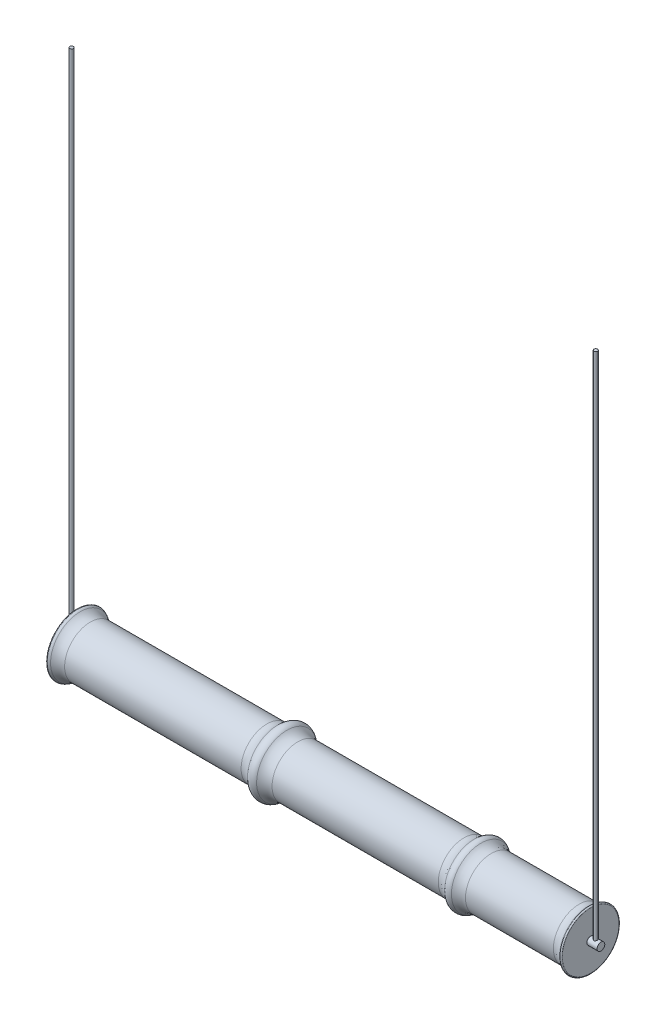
ISO-10303-21;
HEADER;
FILE_DESCRIPTION(('STEP AP214'),'2;1');
FILE_NAME('part.step','',(''),(''),'','','');
FILE_SCHEMA(('AUTOMOTIVE_DESIGN { 1 0 10303 214 1 1 1 1 }'));
ENDSEC;
DATA;
#1=APPLICATION_CONTEXT('core data for automotive mechanical design processes');
#2=APPLICATION_PROTOCOL_DEFINITION('international standard','automotive_design',2000,#1);
#3=PRODUCT_CONTEXT('',#1,'mechanical');
#4=PRODUCT('Part','Part','',(#3));
#5=PRODUCT_RELATED_PRODUCT_CATEGORY('part','',(#4));
#6=PRODUCT_DEFINITION_FORMATION('','',#4);
#7=PRODUCT_DEFINITION_CONTEXT('part definition',#1,'design');
#8=PRODUCT_DEFINITION('design','',#6,#7);
#9=PRODUCT_DEFINITION_SHAPE('','',#8);
#10=(LENGTH_UNIT() NAMED_UNIT(*) SI_UNIT(.MILLI.,.METRE.));
#11=(NAMED_UNIT(*) PLANE_ANGLE_UNIT() SI_UNIT($,.RADIAN.));
#12=(NAMED_UNIT(*) SI_UNIT($,.STERADIAN.) SOLID_ANGLE_UNIT());
#13=UNCERTAINTY_MEASURE_WITH_UNIT(LENGTH_MEASURE(1.E-05),#10,'distance_accuracy_value','');
#14=(GEOMETRIC_REPRESENTATION_CONTEXT(3) GLOBAL_UNCERTAINTY_ASSIGNED_CONTEXT((#13)) GLOBAL_UNIT_ASSIGNED_CONTEXT((#10,
#11,#12)) REPRESENTATION_CONTEXT('',''));
#15=CARTESIAN_POINT('',(0.,0.,0.));
#16=DIRECTION('',(0.,0.,1.));
#17=DIRECTION('',(1.,0.,0.));
#18=AXIS2_PLACEMENT_3D('',#15,#16,#17);
#19=CARTESIAN_POINT('',(-520.,0.,0.));
#20=DIRECTION('',(1.,0.,0.));
#21=DIRECTION('',(0.,0.,1.));
#22=AXIS2_PLACEMENT_3D('',#19,#20,#21);
#23=CYLINDRICAL_SURFACE('',#22,7.5);
#24=CARTESIAN_POINT('',(-520.,0.,0.));
#25=DIRECTION('',(1.,0.,0.));
#26=DIRECTION('',(0.,0.,-1.));
#27=AXIS2_PLACEMENT_3D('',#24,#25,#26);
#28=CIRCLE('',#27,7.5);
#29=CARTESIAN_POINT('',(-520.,0.,-7.5));
#30=VERTEX_POINT('',#29);
#31=EDGE_CURVE('E53',#30,#30,#28,.T.);
#32=ORIENTED_EDGE('',*,*,#31,.T.);
#33=EDGE_LOOP('',(#32));
#34=FACE_BOUND('',#33,.T.);
#35=CARTESIAN_POINT('',(-500.,0.,0.));
#36=DIRECTION('',(1.,0.,0.));
#37=DIRECTION('',(0.,0.,-1.));
#38=AXIS2_PLACEMENT_3D('',#35,#36,#37);
#39=CIRCLE('',#38,7.5);
#40=CARTESIAN_POINT('',(-500.,0.,-7.5));
#41=VERTEX_POINT('',#40);
#42=EDGE_CURVE('E57',#41,#41,#39,.T.);
#43=ORIENTED_EDGE('',*,*,#42,.F.);
#44=EDGE_LOOP('',(#43));
#45=FACE_BOUND('',#44,.T.);
#46=CARTESIAN_POINT('',(-510.,6.63324958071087,-3.50000000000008));
#47=CARTESIAN_POINT('',(-509.90785613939,6.63325043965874,-3.49999926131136));
#48=CARTESIAN_POINT('',(-509.815693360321,6.63517633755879,-3.49635593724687));
#49=CARTESIAN_POINT('',(-509.632061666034,6.64281200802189,-3.48182616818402));
#50=CARTESIAN_POINT('',(-509.540593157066,6.64852384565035,-3.47093577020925));
#51=CARTESIAN_POINT('',(-509.358915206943,6.66354142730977,-3.44201715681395));
#52=CARTESIAN_POINT('',(-509.268708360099,6.67285369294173,-3.42397598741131));
#53=CARTESIAN_POINT('',(-509.090352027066,6.69474455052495,-3.38097200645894));
#54=CARTESIAN_POINT('',(-509.002203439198,6.7073245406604,-3.35600623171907));
#55=CARTESIAN_POINT('',(-508.742636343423,6.74922269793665,-3.27138747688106));
#56=CARTESIAN_POINT('',(-508.575015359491,6.78279629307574,-3.20183735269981));
#57=CARTESIAN_POINT('',(-508.253950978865,6.85741831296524,-3.03871915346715));
#58=CARTESIAN_POINT('',(-508.100506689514,6.8984662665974,-2.94515259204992));
#59=CARTESIAN_POINT('',(-507.799905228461,6.98701266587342,-2.7287822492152));
#60=CARTESIAN_POINT('',(-507.653978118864,7.03476239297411,-2.60436854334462));
#61=CARTESIAN_POINT('',(-507.384129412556,7.12928988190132,-2.33320405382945));
#62=CARTESIAN_POINT('',(-507.260217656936,7.17606720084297,-2.18644333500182));
#63=CARTESIAN_POINT('',(-507.031038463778,7.26656834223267,-1.86452679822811));
#64=CARTESIAN_POINT('',(-506.927232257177,7.30996718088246,-1.68823074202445));
#65=CARTESIAN_POINT('',(-506.751303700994,7.3856412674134,-1.3182776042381));
#66=CARTESIAN_POINT('',(-506.679163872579,7.41792264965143,-1.12463017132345));
#67=CARTESIAN_POINT('',(-506.57331732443,7.46592765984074,-0.738475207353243));
#68=CARTESIAN_POINT('',(-506.537465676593,7.48257054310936,-0.546672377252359));
#69=CARTESIAN_POINT('',(-506.498205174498,7.50081627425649,-0.159103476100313));
#70=CARTESIAN_POINT('',(-506.494779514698,7.50242691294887,0.0366604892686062));
#71=CARTESIAN_POINT('',(-506.519514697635,7.49090759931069,0.410695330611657));
#72=CARTESIAN_POINT('',(-506.545294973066,7.47888852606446,0.589165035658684));
#73=CARTESIAN_POINT('',(-506.623525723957,7.44307550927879,0.938902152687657));
#74=CARTESIAN_POINT('',(-506.675978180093,7.41928069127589,1.11016902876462));
#75=CARTESIAN_POINT('',(-506.806557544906,7.3616983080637,1.44378221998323));
#76=CARTESIAN_POINT('',(-506.885055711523,7.32776699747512,1.60595739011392));
#77=CARTESIAN_POINT('',(-507.065060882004,7.25307965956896,1.9152513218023));
#78=CARTESIAN_POINT('',(-507.166576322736,7.21232113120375,2.06236453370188));
#79=CARTESIAN_POINT('',(-507.399716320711,7.12382550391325,2.35069007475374));
#80=CARTESIAN_POINT('',(-507.533167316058,7.07578970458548,2.49033646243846));
#81=CARTESIAN_POINT('',(-507.821364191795,6.98053903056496,2.74603848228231));
#82=CARTESIAN_POINT('',(-507.976122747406,6.93332466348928,2.86207997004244));
#83=CARTESIAN_POINT('',(-508.312251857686,6.84260060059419,3.0728942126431));
#84=CARTESIAN_POINT('',(-508.494562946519,6.79939178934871,3.16632273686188));
#85=CARTESIAN_POINT('',(-508.77953018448,6.74394606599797,3.28192113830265));
#86=CARTESIAN_POINT('',(-508.8764610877,6.72702242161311,3.31636861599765));
#87=CARTESIAN_POINT('',(-509.073497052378,6.69693644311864,3.37671201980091));
#88=CARTESIAN_POINT('',(-509.173600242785,6.68377193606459,3.40261288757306));
#89=CARTESIAN_POINT('',(-509.36862628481,6.66257769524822,3.44391578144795));
#90=CARTESIAN_POINT('',(-509.463381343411,6.65423909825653,3.45995493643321));
#91=CARTESIAN_POINT('',(-509.654113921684,6.64158034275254,3.48419262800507));
#92=CARTESIAN_POINT('',(-509.75009082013,6.63725821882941,3.49239499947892));
#93=CARTESIAN_POINT('',(-509.94247532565,6.63280265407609,3.50085062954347));
#94=CARTESIAN_POINT('',(-510.038882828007,6.63266824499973,3.50110572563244));
#95=CARTESIAN_POINT('',(-510.231277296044,6.636581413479,3.49367901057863));
#96=CARTESIAN_POINT('',(-510.327264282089,6.64062878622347,3.48599758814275));
#97=CARTESIAN_POINT('',(-510.596335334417,6.65775748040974,3.45324638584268));
#98=CARTESIAN_POINT('',(-510.768113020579,6.67552471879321,3.4190840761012));
#99=CARTESIAN_POINT('',(-511.103146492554,6.72229645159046,3.32616520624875));
#100=CARTESIAN_POINT('',(-511.266399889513,6.75130407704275,3.26740179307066));
#101=CARTESIAN_POINT('',(-511.588352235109,6.81886757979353,3.12403403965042));
#102=CARTESIAN_POINT('',(-511.746496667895,6.85780114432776,3.03836581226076));
#103=CARTESIAN_POINT('',(-512.047021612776,6.94041543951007,2.84459425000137));
#104=CARTESIAN_POINT('',(-512.189394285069,6.98409850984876,2.73647983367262));
#105=CARTESIAN_POINT('',(-512.47022319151,7.07690614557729,2.48734285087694));
#106=CARTESIAN_POINT('',(-512.606637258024,7.12611360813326,2.34403888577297));
#107=CARTESIAN_POINT('',(-512.854008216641,7.22026743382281,2.03561304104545));
#108=CARTESIAN_POINT('',(-512.964959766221,7.26521290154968,1.87048659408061));
#109=CARTESIAN_POINT('',(-513.159434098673,7.34670682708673,1.51947024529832));
#110=CARTESIAN_POINT('',(-513.242530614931,7.38312242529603,1.33331127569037));
#111=CARTESIAN_POINT('',(-513.375474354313,7.4424632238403,0.947480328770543));
#112=CARTESIAN_POINT('',(-513.425346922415,7.46539870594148,0.747818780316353));
#113=CARTESIAN_POINT('',(-513.486672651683,7.49374585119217,0.358651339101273));
#114=CARTESIAN_POINT('',(-513.500985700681,7.50046065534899,0.169689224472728));
#115=CARTESIAN_POINT('',(-513.498909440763,7.49949041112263,-0.208004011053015));
#116=CARTESIAN_POINT('',(-513.48252830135,7.49180919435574,-0.396735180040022));
#117=CARTESIAN_POINT('',(-513.421531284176,7.46365916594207,-0.758277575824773));
#118=CARTESIAN_POINT('',(-513.378439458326,7.44388132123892,-0.931404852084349));
#119=CARTESIAN_POINT('',(-513.267128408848,7.39402864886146,-1.26778311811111));
#120=CARTESIAN_POINT('',(-513.198905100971,7.3639521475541,-1.43103249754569));
#121=CARTESIAN_POINT('',(-513.035923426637,7.29459745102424,-1.75125880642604));
#122=CARTESIAN_POINT('',(-512.940101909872,7.2549637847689,-1.90761543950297));
#123=CARTESIAN_POINT('',(-512.726040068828,7.17088679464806,-2.20271728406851));
#124=CARTESIAN_POINT('',(-512.60778966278,7.12644131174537,-2.34145452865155));
#125=CARTESIAN_POINT('',(-512.340206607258,7.03274489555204,-2.61006924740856));
#126=CARTESIAN_POINT('',(-512.189061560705,6.98341321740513,-2.73811546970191));
#127=CARTESIAN_POINT('',(-511.866192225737,6.88904451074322,-2.96757613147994));
#128=CARTESIAN_POINT('',(-511.694453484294,6.84401053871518,-3.06897170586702));
#129=CARTESIAN_POINT('',(-511.423311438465,6.7836471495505,-3.19913423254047));
#130=CARTESIAN_POINT('',(-511.329950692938,6.76461324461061,-3.23907342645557));
#131=CARTESIAN_POINT('',(-511.139595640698,6.72978037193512,-3.31083809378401));
#132=CARTESIAN_POINT('',(-511.042603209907,6.71397976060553,-3.34266769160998));
#133=CARTESIAN_POINT('',(-510.845956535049,6.68626866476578,-3.39775826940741));
#134=CARTESIAN_POINT('',(-510.746309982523,6.67434803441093,-3.42104161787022));
#135=CARTESIAN_POINT('',(-510.544997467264,6.65484829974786,-3.45882212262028));
#136=CARTESIAN_POINT('',(-510.443333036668,6.64726602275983,-3.47332570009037));
#137=CARTESIAN_POINT('',(-510.284507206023,6.63910656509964,-3.48888207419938));
#138=CARTESIAN_POINT('',(-510.227713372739,6.63691338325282,-3.49304884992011));
#139=CARTESIAN_POINT('',(-510.113948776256,6.63398459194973,-3.49860810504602));
#140=CARTESIAN_POINT('',(-510.056978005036,6.63324904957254,-3.50000045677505));
#141=CARTESIAN_POINT('',(-510.,6.63324958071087,-3.50000000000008));
#142=B_SPLINE_CURVE_WITH_KNOTS('',3,(#46,#47,#48,#49,#50,#51,#52,#53,#54,#55,#56,#57,#58,#59,
#60,#61,#62,#63,#64,#65,#66,#67,#68,#69,#70,#71,#72,#73,#74,#75,#76,#77,#78,#79,#80,#81,#82,#83,
#84,#85,#86,#87,#88,#89,#90,#91,#92,#93,#94,#95,#96,#97,#98,#99,#100,#101,#102,#103,#104,#105,
#106,#107,#108,#109,#110,#111,#112,#113,#114,#115,#116,#117,#118,#119,#120,#121,#122,#123,#124,
#125,#126,#127,#128,#129,#130,#131,#132,#133,#134,#135,#136,#137,#138,#139,#140,#141),
.UNSPECIFIED.,.T.,.F.,(4,2,2,2,2,2,2,2,2,2,2,2,2,2,2,2,2,2,2,2,2,2,2,2,2,2,2,2,2,2,2,2,2,2,2,2,
2,2,2,2,2,2,2,2,2,2,2,4),(0.,0.276372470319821,0.552895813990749,0.82992240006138,
1.10706771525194,1.65810114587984,2.20909985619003,2.79941855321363,3.39000046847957,
4.01417190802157,4.6379983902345,5.22231177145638,5.80632230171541,6.34595217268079,
6.88562212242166,7.43334106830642,7.98126110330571,8.5757804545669,9.17065500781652,
9.79510464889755,10.1074819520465,10.4196783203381,10.7086761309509,10.9975324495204,
11.2863219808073,11.5750973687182,12.100612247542,12.6262736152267,13.1761037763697,
13.7262060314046,14.3350584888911,14.9440385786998,15.561952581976,16.1793946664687,
16.7452887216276,17.3110321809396,17.8471387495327,18.3833324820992,18.9438451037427,
19.5046102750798,20.114337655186,20.7244954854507,21.0340784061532,21.3435035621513,
21.6521129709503,21.9604964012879,22.1313860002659,22.302283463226),.UNSPECIFIED.);
#143=CARTESIAN_POINT('',(-510.,6.63324958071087,-3.50000000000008));
#144=VERTEX_POINT('',#143);
#145=EDGE_CURVE('E11',#144,#144,#142,.T.);
#146=ORIENTED_EDGE('',*,*,#145,.T.);
#147=EDGE_LOOP('',(#146));
#148=FACE_BOUND('',#147,.T.);
#149=ADVANCED_FACE('F42',(#34,#45,#148),#23,.T.);
#150=CARTESIAN_POINT('',(-520.,0.,0.));
#151=DIRECTION('',(-1.,0.,0.));
#152=DIRECTION('',(0.,0.,-1.));
#153=AXIS2_PLACEMENT_3D('',#150,#151,#152);
#154=PLANE('',#153);
#155=ORIENTED_EDGE('',*,*,#31,.F.);
#156=EDGE_LOOP('',(#155));
#157=FACE_BOUND('',#156,.T.);
#158=ADVANCED_FACE('F78',(#157),#154,.T.);
#159=CARTESIAN_POINT('',(-500.,0.,0.));
#160=DIRECTION('',(-1.,0.,0.));
#161=DIRECTION('',(0.,0.,-1.));
#162=AXIS2_PLACEMENT_3D('',#159,#160,#161);
#163=PLANE('',#162);
#164=ORIENTED_EDGE('',*,*,#42,.T.);
#165=EDGE_LOOP('',(#164));
#166=FACE_BOUND('',#165,.T.);
#167=ADVANCED_FACE('F76',(#166),#163,.F.);
#168=CARTESIAN_POINT('',(-510.,1000.,0.));
#169=DIRECTION('',(0.,-1.,0.));
#170=DIRECTION('',(0.,0.,-1.));
#171=AXIS2_PLACEMENT_3D('',#168,#169,#170);
#172=CYLINDRICAL_SURFACE('',#171,3.50000000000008);
#173=CARTESIAN_POINT('',(-510.,1000.,0.));
#174=DIRECTION('',(0.,-1.,0.));
#175=DIRECTION('',(0.,0.,1.));
#176=AXIS2_PLACEMENT_3D('',#173,#174,#175);
#177=CIRCLE('',#176,3.50000000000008);
#178=CARTESIAN_POINT('',(-510.,1000.,3.50000000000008));
#179=VERTEX_POINT('',#178);
#180=EDGE_CURVE('E62',#179,#179,#177,.T.);
#181=ORIENTED_EDGE('',*,*,#180,.T.);
#182=EDGE_LOOP('',(#181));
#183=FACE_BOUND('',#182,.T.);
#184=ORIENTED_EDGE('',*,*,#145,.F.);
#185=EDGE_LOOP('',(#184));
#186=FACE_BOUND('',#185,.T.);
#187=ADVANCED_FACE('F67',(#183,#186),#172,.T.);
#188=CARTESIAN_POINT('',(-510.,1000.,0.));
#189=DIRECTION('',(0.,1.,0.));
#190=DIRECTION('',(0.,0.,1.));
#191=AXIS2_PLACEMENT_3D('',#188,#189,#190);
#192=PLANE('',#191);
#193=ORIENTED_EDGE('',*,*,#180,.F.);
#194=EDGE_LOOP('',(#193));
#195=FACE_BOUND('',#194,.T.);
#196=ADVANCED_FACE('F70',(#195),#192,.T.);
#197=CLOSED_SHELL('',(#149,#158,#167,#187,#196));
#198=MANIFOLD_SOLID_BREP('B2',#197);
#199=CARTESIAN_POINT('',(520.,0.,0.));
#200=DIRECTION('',(-1.,0.,0.));
#201=DIRECTION('',(0.,0.,1.));
#202=AXIS2_PLACEMENT_3D('',#199,#200,#201);
#203=CYLINDRICAL_SURFACE('',#202,7.5);
#204=CARTESIAN_POINT('',(520.,0.,0.));
#205=DIRECTION('',(1.,0.,0.));
#206=DIRECTION('',(0.,0.,-1.));
#207=AXIS2_PLACEMENT_3D('',#204,#205,#206);
#208=CIRCLE('',#207,7.5);
#209=CARTESIAN_POINT('',(520.,0.,-7.5));
#210=VERTEX_POINT('',#209);
#211=EDGE_CURVE('E136',#210,#210,#208,.T.);
#212=ORIENTED_EDGE('',*,*,#211,.F.);
#213=EDGE_LOOP('',(#212));
#214=FACE_BOUND('',#213,.T.);
#215=CARTESIAN_POINT('',(500.,0.,0.));
#216=DIRECTION('',(1.,0.,0.));
#217=DIRECTION('',(0.,0.,-1.));
#218=AXIS2_PLACEMENT_3D('',#215,#216,#217);
#219=CIRCLE('',#218,7.5);
#220=CARTESIAN_POINT('',(500.,0.,-7.5));
#221=VERTEX_POINT('',#220);
#222=EDGE_CURVE('E140',#221,#221,#219,.T.);
#223=ORIENTED_EDGE('',*,*,#222,.T.);
#224=EDGE_LOOP('',(#223));
#225=FACE_BOUND('',#224,.T.);
#226=CARTESIAN_POINT('',(510.,6.63324958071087,-3.50000000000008));
#227=CARTESIAN_POINT('',(509.90785613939,6.63325043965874,-3.49999926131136));
#228=CARTESIAN_POINT('',(509.815693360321,6.63517633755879,-3.49635593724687));
#229=CARTESIAN_POINT('',(509.632061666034,6.64281200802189,-3.48182616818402));
#230=CARTESIAN_POINT('',(509.540593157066,6.64852384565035,-3.47093577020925));
#231=CARTESIAN_POINT('',(509.358915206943,6.66354142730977,-3.44201715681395));
#232=CARTESIAN_POINT('',(509.268708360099,6.67285369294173,-3.42397598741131));
#233=CARTESIAN_POINT('',(509.090352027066,6.69474455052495,-3.38097200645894));
#234=CARTESIAN_POINT('',(509.002203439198,6.7073245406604,-3.35600623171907));
#235=CARTESIAN_POINT('',(508.742636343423,6.74922269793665,-3.27138747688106));
#236=CARTESIAN_POINT('',(508.575015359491,6.78279629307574,-3.20183735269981));
#237=CARTESIAN_POINT('',(508.253950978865,6.85741831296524,-3.03871915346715));
#238=CARTESIAN_POINT('',(508.100506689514,6.8984662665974,-2.94515259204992));
#239=CARTESIAN_POINT('',(507.799905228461,6.98701266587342,-2.7287822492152));
#240=CARTESIAN_POINT('',(507.653978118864,7.03476239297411,-2.60436854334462));
#241=CARTESIAN_POINT('',(507.384129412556,7.12928988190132,-2.33320405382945));
#242=CARTESIAN_POINT('',(507.260217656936,7.17606720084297,-2.18644333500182));
#243=CARTESIAN_POINT('',(507.031038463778,7.26656834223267,-1.86452679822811));
#244=CARTESIAN_POINT('',(506.927232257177,7.30996718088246,-1.68823074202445));
#245=CARTESIAN_POINT('',(506.751303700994,7.3856412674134,-1.3182776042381));
#246=CARTESIAN_POINT('',(506.679163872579,7.41792264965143,-1.12463017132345));
#247=CARTESIAN_POINT('',(506.57331732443,7.46592765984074,-0.738475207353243));
#248=CARTESIAN_POINT('',(506.537465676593,7.48257054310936,-0.546672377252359));
#249=CARTESIAN_POINT('',(506.498205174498,7.50081627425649,-0.159103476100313));
#250=CARTESIAN_POINT('',(506.494779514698,7.50242691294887,0.0366604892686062));
#251=CARTESIAN_POINT('',(506.519514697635,7.49090759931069,0.410695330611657));
#252=CARTESIAN_POINT('',(506.545294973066,7.47888852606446,0.589165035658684));
#253=CARTESIAN_POINT('',(506.623525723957,7.44307550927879,0.938902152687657));
#254=CARTESIAN_POINT('',(506.675978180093,7.41928069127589,1.11016902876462));
#255=CARTESIAN_POINT('',(506.806557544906,7.3616983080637,1.44378221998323));
#256=CARTESIAN_POINT('',(506.885055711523,7.32776699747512,1.60595739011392));
#257=CARTESIAN_POINT('',(507.065060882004,7.25307965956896,1.9152513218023));
#258=CARTESIAN_POINT('',(507.166576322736,7.21232113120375,2.06236453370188));
#259=CARTESIAN_POINT('',(507.399716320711,7.12382550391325,2.35069007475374));
#260=CARTESIAN_POINT('',(507.533167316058,7.07578970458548,2.49033646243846));
#261=CARTESIAN_POINT('',(507.821364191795,6.98053903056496,2.74603848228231));
#262=CARTESIAN_POINT('',(507.976122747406,6.93332466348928,2.86207997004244));
#263=CARTESIAN_POINT('',(508.312251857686,6.84260060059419,3.0728942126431));
#264=CARTESIAN_POINT('',(508.494562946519,6.79939178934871,3.16632273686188));
#265=CARTESIAN_POINT('',(508.77953018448,6.74394606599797,3.28192113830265));
#266=CARTESIAN_POINT('',(508.8764610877,6.72702242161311,3.31636861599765));
#267=CARTESIAN_POINT('',(509.073497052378,6.69693644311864,3.37671201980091));
#268=CARTESIAN_POINT('',(509.173600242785,6.68377193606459,3.40261288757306));
#269=CARTESIAN_POINT('',(509.36862628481,6.66257769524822,3.44391578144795));
#270=CARTESIAN_POINT('',(509.463381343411,6.65423909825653,3.45995493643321));
#271=CARTESIAN_POINT('',(509.654113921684,6.64158034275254,3.48419262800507));
#272=CARTESIAN_POINT('',(509.75009082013,6.63725821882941,3.49239499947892));
#273=CARTESIAN_POINT('',(509.94247532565,6.63280265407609,3.50085062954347));
#274=CARTESIAN_POINT('',(510.038882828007,6.63266824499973,3.50110572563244));
#275=CARTESIAN_POINT('',(510.231277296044,6.636581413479,3.49367901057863));
#276=CARTESIAN_POINT('',(510.327264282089,6.64062878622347,3.48599758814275));
#277=CARTESIAN_POINT('',(510.596335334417,6.65775748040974,3.45324638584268));
#278=CARTESIAN_POINT('',(510.768113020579,6.67552471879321,3.4190840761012));
#279=CARTESIAN_POINT('',(511.103146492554,6.72229645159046,3.32616520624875));
#280=CARTESIAN_POINT('',(511.266399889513,6.75130407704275,3.26740179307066));
#281=CARTESIAN_POINT('',(511.588352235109,6.81886757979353,3.12403403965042));
#282=CARTESIAN_POINT('',(511.746496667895,6.85780114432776,3.03836581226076));
#283=CARTESIAN_POINT('',(512.047021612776,6.94041543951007,2.84459425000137));
#284=CARTESIAN_POINT('',(512.189394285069,6.98409850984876,2.73647983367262));
#285=CARTESIAN_POINT('',(512.47022319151,7.07690614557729,2.48734285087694));
#286=CARTESIAN_POINT('',(512.606637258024,7.12611360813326,2.34403888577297));
#287=CARTESIAN_POINT('',(512.854008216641,7.22026743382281,2.03561304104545));
#288=CARTESIAN_POINT('',(512.964959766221,7.26521290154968,1.87048659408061));
#289=CARTESIAN_POINT('',(513.159434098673,7.34670682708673,1.51947024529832));
#290=CARTESIAN_POINT('',(513.242530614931,7.38312242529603,1.33331127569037));
#291=CARTESIAN_POINT('',(513.375474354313,7.4424632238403,0.947480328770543));
#292=CARTESIAN_POINT('',(513.425346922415,7.46539870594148,0.747818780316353));
#293=CARTESIAN_POINT('',(513.486672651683,7.49374585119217,0.358651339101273));
#294=CARTESIAN_POINT('',(513.500985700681,7.50046065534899,0.169689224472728));
#295=CARTESIAN_POINT('',(513.498909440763,7.49949041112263,-0.208004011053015));
#296=CARTESIAN_POINT('',(513.48252830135,7.49180919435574,-0.396735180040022));
#297=CARTESIAN_POINT('',(513.421531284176,7.46365916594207,-0.758277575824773));
#298=CARTESIAN_POINT('',(513.378439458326,7.44388132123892,-0.931404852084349));
#299=CARTESIAN_POINT('',(513.267128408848,7.39402864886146,-1.26778311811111));
#300=CARTESIAN_POINT('',(513.198905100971,7.3639521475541,-1.43103249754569));
#301=CARTESIAN_POINT('',(513.035923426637,7.29459745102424,-1.75125880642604));
#302=CARTESIAN_POINT('',(512.940101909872,7.2549637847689,-1.90761543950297));
#303=CARTESIAN_POINT('',(512.726040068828,7.17088679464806,-2.20271728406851));
#304=CARTESIAN_POINT('',(512.60778966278,7.12644131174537,-2.34145452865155));
#305=CARTESIAN_POINT('',(512.340206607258,7.03274489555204,-2.61006924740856));
#306=CARTESIAN_POINT('',(512.189061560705,6.98341321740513,-2.73811546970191));
#307=CARTESIAN_POINT('',(511.866192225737,6.88904451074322,-2.96757613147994));
#308=CARTESIAN_POINT('',(511.694453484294,6.84401053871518,-3.06897170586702));
#309=CARTESIAN_POINT('',(511.423311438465,6.7836471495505,-3.19913423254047));
#310=CARTESIAN_POINT('',(511.329950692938,6.76461324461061,-3.23907342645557));
#311=CARTESIAN_POINT('',(511.139595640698,6.72978037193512,-3.31083809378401));
#312=CARTESIAN_POINT('',(511.042603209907,6.71397976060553,-3.34266769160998));
#313=CARTESIAN_POINT('',(510.845956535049,6.68626866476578,-3.39775826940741));
#314=CARTESIAN_POINT('',(510.746309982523,6.67434803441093,-3.42104161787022));
#315=CARTESIAN_POINT('',(510.544997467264,6.65484829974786,-3.45882212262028));
#316=CARTESIAN_POINT('',(510.443333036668,6.64726602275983,-3.47332570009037));
#317=CARTESIAN_POINT('',(510.284507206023,6.63910656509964,-3.48888207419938));
#318=CARTESIAN_POINT('',(510.227713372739,6.63691338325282,-3.49304884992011));
#319=CARTESIAN_POINT('',(510.113948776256,6.63398459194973,-3.49860810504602));
#320=CARTESIAN_POINT('',(510.056978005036,6.63324904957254,-3.50000045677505));
#321=CARTESIAN_POINT('',(510.,6.63324958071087,-3.50000000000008));
#322=B_SPLINE_CURVE_WITH_KNOTS('',3,(#226,#227,#228,#229,#230,#231,#232,#233,#234,#235,#236,
#237,#238,#239,#240,#241,#242,#243,#244,#245,#246,#247,#248,#249,#250,#251,#252,#253,#254,#255,
#256,#257,#258,#259,#260,#261,#262,#263,#264,#265,#266,#267,#268,#269,#270,#271,#272,#273,#274,
#275,#276,#277,#278,#279,#280,#281,#282,#283,#284,#285,#286,#287,#288,#289,#290,#291,#292,#293,
#294,#295,#296,#297,#298,#299,#300,#301,#302,#303,#304,#305,#306,#307,#308,#309,#310,#311,#312,
#313,#314,#315,#316,#317,#318,#319,#320,#321),.UNSPECIFIED.,.T.,.F.,(4,2,2,2,2,2,2,2,2,2,2,2,2,
2,2,2,2,2,2,2,2,2,2,2,2,2,2,2,2,2,2,2,2,2,2,2,2,2,2,2,2,2,2,2,2,2,2,4),(0.,0.276372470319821,
0.552895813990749,0.82992240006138,1.10706771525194,1.65810114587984,2.20909985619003,
2.79941855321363,3.39000046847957,4.01417190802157,4.6379983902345,5.22231177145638,
5.80632230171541,6.34595217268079,6.88562212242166,7.43334106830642,7.98126110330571,
8.5757804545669,9.17065500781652,9.79510464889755,10.1074819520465,10.4196783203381,
10.7086761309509,10.9975324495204,11.2863219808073,11.5750973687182,12.100612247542,
12.6262736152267,13.1761037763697,13.7262060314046,14.3350584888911,14.9440385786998,
15.561952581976,16.1793946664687,16.7452887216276,17.3110321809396,17.8471387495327,
18.3833324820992,18.9438451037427,19.5046102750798,20.114337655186,20.7244954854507,
21.0340784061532,21.3435035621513,21.6521129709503,21.9604964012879,22.1313860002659,
22.302283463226),.UNSPECIFIED.);
#323=CARTESIAN_POINT('',(510.,6.63324958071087,-3.50000000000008));
#324=VERTEX_POINT('',#323);
#325=EDGE_CURVE('E41',#324,#324,#322,.T.);
#326=ORIENTED_EDGE('',*,*,#325,.F.);
#327=EDGE_LOOP('',(#326));
#328=FACE_BOUND('',#327,.T.);
#329=ADVANCED_FACE('F125',(#214,#225,#328),#203,.T.);
#330=CARTESIAN_POINT('',(520.,0.,0.));
#331=DIRECTION('',(1.,0.,0.));
#332=DIRECTION('',(0.,0.,-1.));
#333=AXIS2_PLACEMENT_3D('',#330,#331,#332);
#334=PLANE('',#333);
#335=ORIENTED_EDGE('',*,*,#211,.T.);
#336=EDGE_LOOP('',(#335));
#337=FACE_BOUND('',#336,.T.);
#338=ADVANCED_FACE('F160',(#337),#334,.T.);
#339=CARTESIAN_POINT('',(500.,0.,0.));
#340=DIRECTION('',(1.,0.,0.));
#341=DIRECTION('',(0.,0.,-1.));
#342=AXIS2_PLACEMENT_3D('',#339,#340,#341);
#343=PLANE('',#342);
#344=ORIENTED_EDGE('',*,*,#222,.F.);
#345=EDGE_LOOP('',(#344));
#346=FACE_BOUND('',#345,.T.);
#347=ADVANCED_FACE('F154',(#346),#343,.F.);
#348=CARTESIAN_POINT('',(510.,1000.,0.));
#349=DIRECTION('',(0.,-1.,0.));
#350=DIRECTION('',(0.,0.,-1.));
#351=AXIS2_PLACEMENT_3D('',#348,#349,#350);
#352=CYLINDRICAL_SURFACE('',#351,3.50000000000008);
#353=CARTESIAN_POINT('',(510.,1000.,0.));
#354=DIRECTION('',(0.,1.,0.));
#355=DIRECTION('',(0.,0.,1.));
#356=AXIS2_PLACEMENT_3D('',#353,#354,#355);
#357=CIRCLE('',#356,3.50000000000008);
#358=CARTESIAN_POINT('',(510.,1000.,3.50000000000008));
#359=VERTEX_POINT('',#358);
#360=EDGE_CURVE('E145',#359,#359,#357,.T.);
#361=ORIENTED_EDGE('',*,*,#360,.F.);
#362=EDGE_LOOP('',(#361));
#363=FACE_BOUND('',#362,.T.);
#364=ORIENTED_EDGE('',*,*,#325,.T.);
#365=EDGE_LOOP('',(#364));
#366=FACE_BOUND('',#365,.T.);
#367=ADVANCED_FACE('F152',(#363,#366),#352,.T.);
#368=CARTESIAN_POINT('',(510.,1000.,0.));
#369=DIRECTION('',(0.,1.,0.));
#370=DIRECTION('',(0.,0.,1.));
#371=AXIS2_PLACEMENT_3D('',#368,#369,#370);
#372=PLANE('',#371);
#373=ORIENTED_EDGE('',*,*,#360,.T.);
#374=EDGE_LOOP('',(#373));
#375=FACE_BOUND('',#374,.T.);
#376=ADVANCED_FACE('F150',(#375),#372,.T.);
#377=CLOSED_SHELL('',(#329,#338,#347,#367,#376));
#378=MANIFOLD_SOLID_BREP('B6',#377);
#379=CARTESIAN_POINT('',(500.,57.5000000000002,0.));
#380=DIRECTION('',(-1.,0.,0.));
#381=DIRECTION('',(0.,-1.,0.));
#382=AXIS2_PLACEMENT_3D('',#379,#380,#381);
#383=PLANE('',#382);
#384=CARTESIAN_POINT('',(500.,1.80411241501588E-13,0.));
#385=DIRECTION('',(-1.,0.,0.));
#386=DIRECTION('',(0.,-1.,0.));
#387=AXIS2_PLACEMENT_3D('',#384,#385,#386);
#388=CIRCLE('',#387,55.1234753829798);
#389=CARTESIAN_POINT('',(500.,-55.1234753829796,0.));
#390=VERTEX_POINT('',#389);
#391=EDGE_CURVE('E212',#390,#390,#388,.F.);
#392=ORIENTED_EDGE('',*,*,#391,.T.);
#393=EDGE_LOOP('',(#392));
#394=FACE_BOUND('',#393,.T.);
#395=ADVANCED_FACE('F201',(#394),#383,.F.);
#396=CARTESIAN_POINT('',(500.,1.80411241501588E-13,0.));
#397=DIRECTION('',(-1.,0.,0.));
#398=DIRECTION('',(0.,-1.,0.));
#399=AXIS2_PLACEMENT_3D('',#396,#397,#398);
#400=TOROIDAL_SURFACE('',#399,50.,7.49999999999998);
#401=CARTESIAN_POINT('',(497.272727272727,1.7991024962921E-13,0.));
#402=DIRECTION('',(1.,0.,0.));
#403=DIRECTION('',(0.,1.,0.));
#404=AXIS2_PLACEMENT_3D('',#401,#402,#403);
#405=CIRCLE('',#404,56.9865573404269);
#406=CARTESIAN_POINT('',(497.272727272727,56.9865573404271,0.));
#407=VERTEX_POINT('',#406);
#408=EDGE_CURVE('E216',#407,#407,#405,.F.);
#409=ORIENTED_EDGE('',*,*,#408,.T.);
#410=EDGE_LOOP('',(#409));
#411=FACE_BOUND('',#410,.T.);
#412=CARTESIAN_POINT('',(495.5,1.79584604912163E-13,0.));
#413=DIRECTION('',(1.,0.,0.));
#414=DIRECTION('',(0.,1.,0.));
#415=AXIS2_PLACEMENT_3D('',#412,#413,#414);
#416=CIRCLE('',#415,55.9999999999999);
#417=CARTESIAN_POINT('',(495.5,56.0000000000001,0.));
#418=VERTEX_POINT('',#417);
#419=EDGE_CURVE('E248',#418,#418,#416,.T.);
#420=ORIENTED_EDGE('',*,*,#419,.T.);
#421=EDGE_LOOP('',(#420));
#422=FACE_BOUND('',#421,.T.);
#423=ADVANCED_FACE('F325',(#411,#422),#400,.T.);
#424=CARTESIAN_POINT('',(-500.,0.,0.));
#425=DIRECTION('',(-1.,0.,0.));
#426=DIRECTION('',(0.,-1.,0.));
#427=AXIS2_PLACEMENT_3D('',#424,#425,#426);
#428=CYLINDRICAL_SURFACE('',#427,49.9999999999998);
#429=CARTESIAN_POINT('',(477.5,1.79563836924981E-13,0.));
#430=DIRECTION('',(-1.,0.,0.));
#431=DIRECTION('',(0.,-1.,0.));
#432=AXIS2_PLACEMENT_3D('',#429,#430,#431);
#433=CIRCLE('',#432,49.9999999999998);
#434=CARTESIAN_POINT('',(477.5,-49.9999999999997,0.));
#435=VERTEX_POINT('',#434);
#436=EDGE_CURVE('E251',#435,#435,#433,.T.);
#437=ORIENTED_EDGE('',*,*,#436,.T.);
#438=EDGE_LOOP('',(#437));
#439=FACE_BOUND('',#438,.T.);
#440=CARTESIAN_POINT('',(306.457513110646,1.48143841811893E-13,0.));
#441=DIRECTION('',(-1.,0.,0.));
#442=DIRECTION('',(0.,-1.,0.));
#443=AXIS2_PLACEMENT_3D('',#440,#441,#442);
#444=CIRCLE('',#443,49.9999999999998);
#445=CARTESIAN_POINT('',(306.457513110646,-49.9999999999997,0.));
#446=VERTEX_POINT('',#445);
#447=EDGE_CURVE('E254',#446,#446,#444,.F.);
#448=ORIENTED_EDGE('',*,*,#447,.T.);
#449=EDGE_LOOP('',(#448));
#450=FACE_BOUND('',#449,.T.);
#451=ADVANCED_FACE('F258',(#439,#450),#428,.T.);
#452=CARTESIAN_POINT('',(280.,1.45716771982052E-13,0.));
#453=DIRECTION('',(-1.,0.,0.));
#454=DIRECTION('',(0.,-1.,0.));
#455=AXIS2_PLACEMENT_3D('',#452,#453,#454);
#456=TOROIDAL_SURFACE('',#455,49.9999999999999,10.);
#457=CARTESIAN_POINT('',(286.614378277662,1.46931813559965E-13,0.));
#458=DIRECTION('',(-1.,0.,0.));
#459=DIRECTION('',(0.,-1.,0.));
#460=AXIS2_PLACEMENT_3D('',#457,#458,#459);
#461=CIRCLE('',#460,57.4999999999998);
#462=CARTESIAN_POINT('',(286.614378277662,-57.4999999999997,0.));
#463=VERTEX_POINT('',#462);
#464=EDGE_CURVE('E242',#463,#463,#461,.T.);
#465=ORIENTED_EDGE('',*,*,#464,.T.);
#466=EDGE_LOOP('',(#465));
#467=FACE_BOUND('',#466,.T.);
#468=CARTESIAN_POINT('',(273.385621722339,1.44501730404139E-13,0.));
#469=DIRECTION('',(1.,0.,0.));
#470=DIRECTION('',(0.,1.,0.));
#471=AXIS2_PLACEMENT_3D('',#468,#469,#470);
#472=CIRCLE('',#471,57.4999999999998);
#473=CARTESIAN_POINT('',(273.385621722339,57.5,0.));
#474=VERTEX_POINT('',#473);
#475=EDGE_CURVE('E245',#474,#474,#472,.T.);
#476=ORIENTED_EDGE('',*,*,#475,.T.);
#477=EDGE_LOOP('',(#476));
#478=FACE_BOUND('',#477,.T.);
#479=ADVANCED_FACE('F268',(#467,#478),#456,.T.);
#480=CARTESIAN_POINT('',(-500.,0.,0.));
#481=DIRECTION('',(-1.,0.,0.));
#482=DIRECTION('',(0.,-1.,0.));
#483=AXIS2_PLACEMENT_3D('',#480,#481,#482);
#484=CYLINDRICAL_SURFACE('',#483,49.9999999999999);
#485=CARTESIAN_POINT('',(253.542486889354,1.38423509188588E-13,0.));
#486=DIRECTION('',(-1.,0.,0.));
#487=DIRECTION('',(0.,-1.,0.));
#488=AXIS2_PLACEMENT_3D('',#485,#486,#487);
#489=CIRCLE('',#488,49.9999999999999);
#490=CARTESIAN_POINT('',(253.542486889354,-49.9999999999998,0.));
#491=VERTEX_POINT('',#490);
#492=EDGE_CURVE('E236',#491,#491,#489,.T.);
#493=ORIENTED_EDGE('',*,*,#492,.T.);
#494=EDGE_LOOP('',(#493));
#495=FACE_BOUND('',#494,.T.);
#496=CARTESIAN_POINT('',(-69.8960135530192,0.,0.));
#497=DIRECTION('',(-1.,0.,0.));
#498=DIRECTION('',(0.,-1.,0.));
#499=AXIS2_PLACEMENT_3D('',#496,#497,#498);
#500=CIRCLE('',#499,49.9999999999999);
#501=CARTESIAN_POINT('',(-69.8960135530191,-49.9999999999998,0.));
#502=VERTEX_POINT('',#501);
#503=EDGE_CURVE('E239',#502,#502,#500,.F.);
#504=ORIENTED_EDGE('',*,*,#503,.T.);
#505=EDGE_LOOP('',(#504));
#506=FACE_BOUND('',#505,.T.);
#507=ADVANCED_FACE('F271',(#495,#506),#484,.T.);
#508=CARTESIAN_POINT('',(-100.,0.,0.));
#509=DIRECTION('',(-1.,0.,0.));
#510=DIRECTION('',(0.,-1.,0.));
#511=AXIS2_PLACEMENT_3D('',#508,#509,#510);
#512=TOROIDAL_SURFACE('',#511,49.9999999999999,12.5);
#513=CARTESIAN_POINT('',(-91.1458863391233,0.,0.));
#514=DIRECTION('',(-1.,0.,0.));
#515=DIRECTION('',(0.,-1.,0.));
#516=AXIS2_PLACEMENT_3D('',#513,#514,#515);
#517=CIRCLE('',#516,58.8235294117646);
#518=CARTESIAN_POINT('',(-91.1458863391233,-58.8235294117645,0.));
#519=VERTEX_POINT('',#518);
#520=EDGE_CURVE('E230',#519,#519,#517,.T.);
#521=ORIENTED_EDGE('',*,*,#520,.T.);
#522=EDGE_LOOP('',(#521));
#523=FACE_BOUND('',#522,.T.);
#524=CARTESIAN_POINT('',(-108.854113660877,0.,0.));
#525=DIRECTION('',(1.,0.,0.));
#526=DIRECTION('',(0.,1.,0.));
#527=AXIS2_PLACEMENT_3D('',#524,#525,#526);
#528=CIRCLE('',#527,58.8235294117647);
#529=CARTESIAN_POINT('',(-108.854113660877,58.8235294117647,0.));
#530=VERTEX_POINT('',#529);
#531=EDGE_CURVE('E233',#530,#530,#528,.T.);
#532=ORIENTED_EDGE('',*,*,#531,.T.);
#533=EDGE_LOOP('',(#532));
#534=FACE_BOUND('',#533,.T.);
#535=ADVANCED_FACE('F283',(#523,#534),#512,.T.);
#536=CARTESIAN_POINT('',(-500.,0.,0.));
#537=DIRECTION('',(-1.,0.,0.));
#538=DIRECTION('',(0.,-1.,0.));
#539=AXIS2_PLACEMENT_3D('',#536,#537,#538);
#540=CYLINDRICAL_SURFACE('',#539,50.);
#541=CARTESIAN_POINT('',(-130.103986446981,0.,0.));
#542=DIRECTION('',(-1.,0.,0.));
#543=DIRECTION('',(0.,-1.,0.));
#544=AXIS2_PLACEMENT_3D('',#541,#542,#543);
#545=CIRCLE('',#544,50.);
#546=CARTESIAN_POINT('',(-130.103986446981,-49.9999999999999,0.));
#547=VERTEX_POINT('',#546);
#548=EDGE_CURVE('E224',#547,#547,#545,.T.);
#549=ORIENTED_EDGE('',*,*,#548,.T.);
#550=EDGE_LOOP('',(#549));
#551=FACE_BOUND('',#550,.T.);
#552=CARTESIAN_POINT('',(-473.542486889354,0.,0.));
#553=DIRECTION('',(-1.,0.,0.));
#554=DIRECTION('',(0.,-1.,0.));
#555=AXIS2_PLACEMENT_3D('',#552,#553,#554);
#556=CIRCLE('',#555,50.);
#557=CARTESIAN_POINT('',(-473.542486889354,-50.,0.));
#558=VERTEX_POINT('',#557);
#559=EDGE_CURVE('E227',#558,#558,#556,.F.);
#560=ORIENTED_EDGE('',*,*,#559,.T.);
#561=EDGE_LOOP('',(#560));
#562=FACE_BOUND('',#561,.T.);
#563=ADVANCED_FACE('F295',(#551,#562),#540,.T.);
#564=CARTESIAN_POINT('',(-500.,0.,0.));
#565=DIRECTION('',(-1.,0.,0.));
#566=DIRECTION('',(0.,-1.,0.));
#567=AXIS2_PLACEMENT_3D('',#564,#565,#566);
#568=TOROIDAL_SURFACE('',#567,50.,10.);
#569=CARTESIAN_POINT('',(-497.5,0.,0.));
#570=DIRECTION('',(-1.,0.,0.));
#571=DIRECTION('',(0.,-1.,0.));
#572=AXIS2_PLACEMENT_3D('',#569,#570,#571);
#573=CIRCLE('',#572,59.6824583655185);
#574=CARTESIAN_POINT('',(-497.5,-59.6824583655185,0.));
#575=VERTEX_POINT('',#574);
#576=EDGE_CURVE('E124',#575,#575,#573,.F.);
#577=ORIENTED_EDGE('',*,*,#576,.T.);
#578=EDGE_LOOP('',(#577));
#579=FACE_BOUND('',#578,.T.);
#580=CARTESIAN_POINT('',(-493.385621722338,0.,0.));
#581=DIRECTION('',(-1.,0.,0.));
#582=DIRECTION('',(0.,-1.,0.));
#583=AXIS2_PLACEMENT_3D('',#580,#581,#582);
#584=CIRCLE('',#583,57.4999999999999);
#585=CARTESIAN_POINT('',(-493.385621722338,-57.4999999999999,0.));
#586=VERTEX_POINT('',#585);
#587=EDGE_CURVE('E221',#586,#586,#584,.T.);
#588=ORIENTED_EDGE('',*,*,#587,.T.);
#589=EDGE_LOOP('',(#588));
#590=FACE_BOUND('',#589,.T.);
#591=ADVANCED_FACE('F307',(#579,#590),#568,.T.);
#592=CARTESIAN_POINT('',(-500.,60.,0.));
#593=DIRECTION('',(1.,0.,0.));
#594=DIRECTION('',(0.,1.,0.));
#595=AXIS2_PLACEMENT_3D('',#592,#593,#594);
#596=PLANE('',#595);
#597=CARTESIAN_POINT('',(-500.,0.,0.));
#598=DIRECTION('',(1.,0.,0.));
#599=DIRECTION('',(0.,1.,0.));
#600=AXIS2_PLACEMENT_3D('',#597,#598,#599);
#601=CIRCLE('',#600,57.7459666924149);
#602=CARTESIAN_POINT('',(-500.,57.7459666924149,0.));
#603=VERTEX_POINT('',#602);
#604=EDGE_CURVE('E208',#603,#603,#601,.F.);
#605=ORIENTED_EDGE('',*,*,#604,.T.);
#606=EDGE_LOOP('',(#605));
#607=FACE_BOUND('',#606,.T.);
#608=ADVANCED_FACE('F318',(#607),#596,.F.);
#609=CARTESIAN_POINT('',(477.5,1.77920947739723E-13,0.));
#610=DIRECTION('',(-1.,0.,0.));
#611=DIRECTION('',(0.,-1.,0.));
#612=AXIS2_PLACEMENT_3D('',#609,#610,#611);
#613=TOROIDAL_SURFACE('',#612,79.9999999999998,30.);
#614=ORIENTED_EDGE('',*,*,#419,.F.);
#615=EDGE_LOOP('',(#614));
#616=FACE_BOUND('',#615,.T.);
#617=ORIENTED_EDGE('',*,*,#436,.F.);
#618=EDGE_LOOP('',(#617));
#619=FACE_BOUND('',#618,.T.);
#620=ADVANCED_FACE('F264',(#616,#619),#613,.F.);
#621=CARTESIAN_POINT('',(306.457513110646,1.49360390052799E-13,0.));
#622=DIRECTION('',(-1.,0.,0.));
#623=DIRECTION('',(0.,-1.,0.));
#624=AXIS2_PLACEMENT_3D('',#621,#622,#623);
#625=TOROIDAL_SURFACE('',#624,79.9999999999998,30.);
#626=ORIENTED_EDGE('',*,*,#447,.F.);
#627=EDGE_LOOP('',(#626));
#628=FACE_BOUND('',#627,.T.);
#629=ORIENTED_EDGE('',*,*,#464,.F.);
#630=EDGE_LOOP('',(#629));
#631=FACE_BOUND('',#630,.T.);
#632=ADVANCED_FACE('F260',(#628,#631),#625,.F.);
#633=CARTESIAN_POINT('',(253.542486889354,1.39640057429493E-13,0.));
#634=DIRECTION('',(-1.,0.,0.));
#635=DIRECTION('',(0.,-1.,0.));
#636=AXIS2_PLACEMENT_3D('',#633,#634,#635);
#637=TOROIDAL_SURFACE('',#636,79.9999999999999,30.);
#638=ORIENTED_EDGE('',*,*,#475,.F.);
#639=EDGE_LOOP('',(#638));
#640=FACE_BOUND('',#639,.T.);
#641=ORIENTED_EDGE('',*,*,#492,.F.);
#642=EDGE_LOOP('',(#641));
#643=FACE_BOUND('',#642,.T.);
#644=ADVANCED_FACE('F263',(#640,#643),#637,.F.);
#645=CARTESIAN_POINT('',(-69.8960135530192,0.,0.));
#646=DIRECTION('',(-1.,0.,0.));
#647=DIRECTION('',(0.,-1.,0.));
#648=AXIS2_PLACEMENT_3D('',#645,#646,#647);
#649=TOROIDAL_SURFACE('',#648,79.9999999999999,30.);
#650=ORIENTED_EDGE('',*,*,#503,.F.);
#651=EDGE_LOOP('',(#650));
#652=FACE_BOUND('',#651,.T.);
#653=ORIENTED_EDGE('',*,*,#520,.F.);
#654=EDGE_LOOP('',(#653));
#655=FACE_BOUND('',#654,.T.);
#656=ADVANCED_FACE('F277',(#652,#655),#649,.F.);
#657=CARTESIAN_POINT('',(-130.103986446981,0.,0.));
#658=DIRECTION('',(-1.,0.,0.));
#659=DIRECTION('',(0.,-1.,0.));
#660=AXIS2_PLACEMENT_3D('',#657,#658,#659);
#661=TOROIDAL_SURFACE('',#660,80.,30.);
#662=ORIENTED_EDGE('',*,*,#531,.F.);
#663=EDGE_LOOP('',(#662));
#664=FACE_BOUND('',#663,.T.);
#665=ORIENTED_EDGE('',*,*,#548,.F.);
#666=EDGE_LOOP('',(#665));
#667=FACE_BOUND('',#666,.T.);
#668=ADVANCED_FACE('F289',(#664,#667),#661,.F.);
#669=CARTESIAN_POINT('',(-473.542486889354,0.,0.));
#670=DIRECTION('',(-1.,0.,0.));
#671=DIRECTION('',(0.,-1.,0.));
#672=AXIS2_PLACEMENT_3D('',#669,#670,#671);
#673=TOROIDAL_SURFACE('',#672,80.,30.);
#674=ORIENTED_EDGE('',*,*,#559,.F.);
#675=EDGE_LOOP('',(#674));
#676=FACE_BOUND('',#675,.T.);
#677=ORIENTED_EDGE('',*,*,#587,.F.);
#678=EDGE_LOOP('',(#677));
#679=FACE_BOUND('',#678,.T.);
#680=ADVANCED_FACE('F301',(#676,#679),#673,.F.);
#681=CARTESIAN_POINT('',(498.,1.80043847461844E-13,0.));
#682=DIRECTION('',(-1.,0.,0.));
#683=DIRECTION('',(0.,-1.,0.));
#684=AXIS2_PLACEMENT_3D('',#681,#682,#683);
#685=TOROIDAL_SURFACE('',#684,55.1234753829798,2.);
#686=ORIENTED_EDGE('',*,*,#391,.F.);
#687=EDGE_LOOP('',(#686));
#688=FACE_BOUND('',#687,.T.);
#689=ORIENTED_EDGE('',*,*,#408,.F.);
#690=EDGE_LOOP('',(#689));
#691=FACE_BOUND('',#690,.T.);
#692=ADVANCED_FACE('F313',(#688,#691),#685,.T.);
#693=CARTESIAN_POINT('',(-498.,0.,0.));
#694=DIRECTION('',(1.,0.,0.));
#695=DIRECTION('',(0.,1.,0.));
#696=AXIS2_PLACEMENT_3D('',#693,#694,#695);
#697=TOROIDAL_SURFACE('',#696,57.7459666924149,2.);
#698=ORIENTED_EDGE('',*,*,#576,.F.);
#699=EDGE_LOOP('',(#698));
#700=FACE_BOUND('',#699,.T.);
#701=ORIENTED_EDGE('',*,*,#604,.F.);
#702=EDGE_LOOP('',(#701));
#703=FACE_BOUND('',#702,.T.);
#704=ADVANCED_FACE('F203',(#700,#703),#697,.T.);
#705=CLOSED_SHELL('',(#395,#423,#451,#479,#507,#535,#563,#591,#608,#620,#632,#644,#656,#668,
#680,#692,#704));
#706=MANIFOLD_SOLID_BREP('B36',#705);
#707=ADVANCED_BREP_SHAPE_REPRESENTATION('',(#18,#198,#378,#706),#14);
#708=SHAPE_DEFINITION_REPRESENTATION(#9,#707);
ENDSEC;
END-ISO-10303-21;
